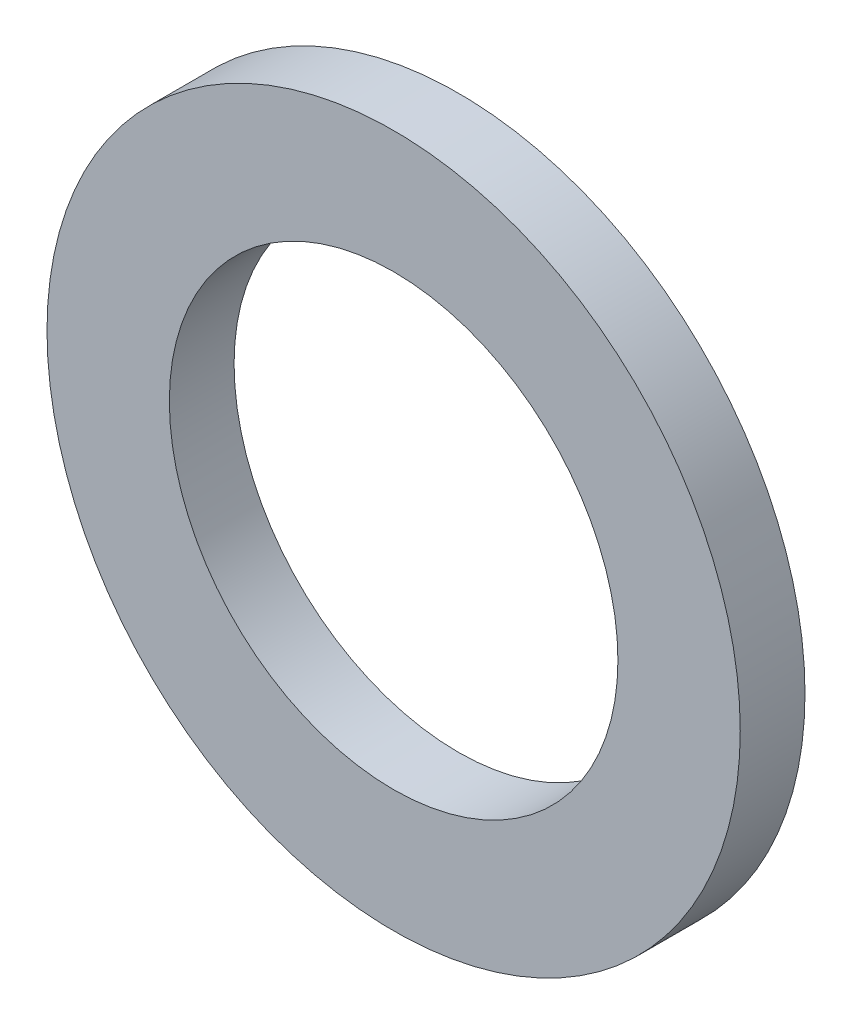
ISO-10303-21;
HEADER;
FILE_DESCRIPTION(('STEP AP214'),'2;1');
FILE_NAME('part.step','',(''),(''),'','','');
FILE_SCHEMA(('AUTOMOTIVE_DESIGN { 1 0 10303 214 1 1 1 1 }'));
ENDSEC;
DATA;
#1=APPLICATION_CONTEXT('core data for automotive mechanical design processes');
#2=APPLICATION_PROTOCOL_DEFINITION('international standard','automotive_design',2000,#1);
#3=PRODUCT_CONTEXT('',#1,'mechanical');
#4=PRODUCT('Part','Part','',(#3));
#5=PRODUCT_RELATED_PRODUCT_CATEGORY('part','',(#4));
#6=PRODUCT_DEFINITION_FORMATION('','',#4);
#7=PRODUCT_DEFINITION_CONTEXT('part definition',#1,'design');
#8=PRODUCT_DEFINITION('design','',#6,#7);
#9=PRODUCT_DEFINITION_SHAPE('','',#8);
#10=(LENGTH_UNIT() NAMED_UNIT(*) SI_UNIT(.MILLI.,.METRE.));
#11=(NAMED_UNIT(*) PLANE_ANGLE_UNIT() SI_UNIT($,.RADIAN.));
#12=(NAMED_UNIT(*) SI_UNIT($,.STERADIAN.) SOLID_ANGLE_UNIT());
#13=UNCERTAINTY_MEASURE_WITH_UNIT(LENGTH_MEASURE(1.E-05),#10,'distance_accuracy_value','');
#14=(GEOMETRIC_REPRESENTATION_CONTEXT(3) GLOBAL_UNCERTAINTY_ASSIGNED_CONTEXT((#13)) GLOBAL_UNIT_ASSIGNED_CONTEXT((#10,
#11,#12)) REPRESENTATION_CONTEXT('',''));
#15=CARTESIAN_POINT('',(0.,0.,0.));
#16=DIRECTION('',(0.,0.,1.));
#17=DIRECTION('',(1.,0.,0.));
#18=AXIS2_PLACEMENT_3D('',#15,#16,#17);
#19=CARTESIAN_POINT('',(0.,0.,3.175));
#20=DIRECTION('',(0.,0.,1.));
#21=DIRECTION('',(1.,0.,0.));
#22=AXIS2_PLACEMENT_3D('',#19,#20,#21);
#23=PLANE('',#22);
#24=CARTESIAN_POINT('',(0.,0.,3.175));
#25=DIRECTION('',(0.,0.,1.));
#26=DIRECTION('',(1.,0.,0.));
#27=AXIS2_PLACEMENT_3D('',#24,#25,#26);
#28=CIRCLE('',#27,17.);
#29=CARTESIAN_POINT('',(17.,0.,3.175));
#30=VERTEX_POINT('',#29);
#31=EDGE_CURVE('E10',#30,#30,#28,.T.);
#32=ORIENTED_EDGE('',*,*,#31,.T.);
#33=EDGE_LOOP('',(#32));
#34=FACE_BOUND('',#33,.T.);
#35=CARTESIAN_POINT('',(0.,0.,3.175));
#36=DIRECTION('',(0.,0.,1.));
#37=DIRECTION('',(1.,0.,0.));
#38=AXIS2_PLACEMENT_3D('',#35,#36,#37);
#39=CIRCLE('',#38,11.);
#40=CARTESIAN_POINT('',(11.,0.,3.175));
#41=VERTEX_POINT('',#40);
#42=EDGE_CURVE('E42',#41,#41,#39,.T.);
#43=ORIENTED_EDGE('',*,*,#42,.F.);
#44=EDGE_LOOP('',(#43));
#45=FACE_BOUND('',#44,.T.);
#46=ADVANCED_FACE('F31',(#34,#45),#23,.T.);
#47=CARTESIAN_POINT('',(0.,0.,0.));
#48=DIRECTION('',(0.,0.,1.));
#49=DIRECTION('',(1.,0.,0.));
#50=AXIS2_PLACEMENT_3D('',#47,#48,#49);
#51=PLANE('',#50);
#52=CARTESIAN_POINT('',(0.,0.,0.));
#53=DIRECTION('',(0.,0.,1.));
#54=DIRECTION('',(1.,0.,0.));
#55=AXIS2_PLACEMENT_3D('',#52,#53,#54);
#56=CIRCLE('',#55,17.);
#57=CARTESIAN_POINT('',(17.,0.,0.));
#58=VERTEX_POINT('',#57);
#59=EDGE_CURVE('E35',#58,#58,#56,.T.);
#60=ORIENTED_EDGE('',*,*,#59,.F.);
#61=EDGE_LOOP('',(#60));
#62=FACE_BOUND('',#61,.T.);
#63=CARTESIAN_POINT('',(0.,0.,0.));
#64=DIRECTION('',(0.,0.,1.));
#65=DIRECTION('',(1.,0.,0.));
#66=AXIS2_PLACEMENT_3D('',#63,#64,#65);
#67=CIRCLE('',#66,11.);
#68=CARTESIAN_POINT('',(11.,0.,0.));
#69=VERTEX_POINT('',#68);
#70=EDGE_CURVE('E44',#69,#69,#67,.T.);
#71=ORIENTED_EDGE('',*,*,#70,.T.);
#72=EDGE_LOOP('',(#71));
#73=FACE_BOUND('',#72,.T.);
#74=ADVANCED_FACE('F54',(#62,#73),#51,.F.);
#75=CARTESIAN_POINT('',(0.,0.,3.175));
#76=DIRECTION('',(0.,0.,-1.));
#77=DIRECTION('',(-1.,0.,0.));
#78=AXIS2_PLACEMENT_3D('',#75,#76,#77);
#79=CYLINDRICAL_SURFACE('',#78,17.);
#80=ORIENTED_EDGE('',*,*,#31,.F.);
#81=EDGE_LOOP('',(#80));
#82=FACE_BOUND('',#81,.T.);
#83=ORIENTED_EDGE('',*,*,#59,.T.);
#84=EDGE_LOOP('',(#83));
#85=FACE_BOUND('',#84,.T.);
#86=ADVANCED_FACE('F33',(#82,#85),#79,.T.);
#87=CARTESIAN_POINT('',(0.,0.,3.175));
#88=DIRECTION('',(0.,0.,-1.));
#89=DIRECTION('',(-1.,0.,0.));
#90=AXIS2_PLACEMENT_3D('',#87,#88,#89);
#91=CYLINDRICAL_SURFACE('',#90,11.);
#92=ORIENTED_EDGE('',*,*,#42,.T.);
#93=EDGE_LOOP('',(#92));
#94=FACE_BOUND('',#93,.T.);
#95=ORIENTED_EDGE('',*,*,#70,.F.);
#96=EDGE_LOOP('',(#95));
#97=FACE_BOUND('',#96,.T.);
#98=ADVANCED_FACE('F50',(#94,#97),#91,.F.);
#99=CLOSED_SHELL('',(#46,#74,#86,#98));
#100=MANIFOLD_SOLID_BREP('B2',#99);
#101=ADVANCED_BREP_SHAPE_REPRESENTATION('',(#18,#100),#14);
#102=SHAPE_DEFINITION_REPRESENTATION(#9,#101);
ENDSEC;
END-ISO-10303-21;
